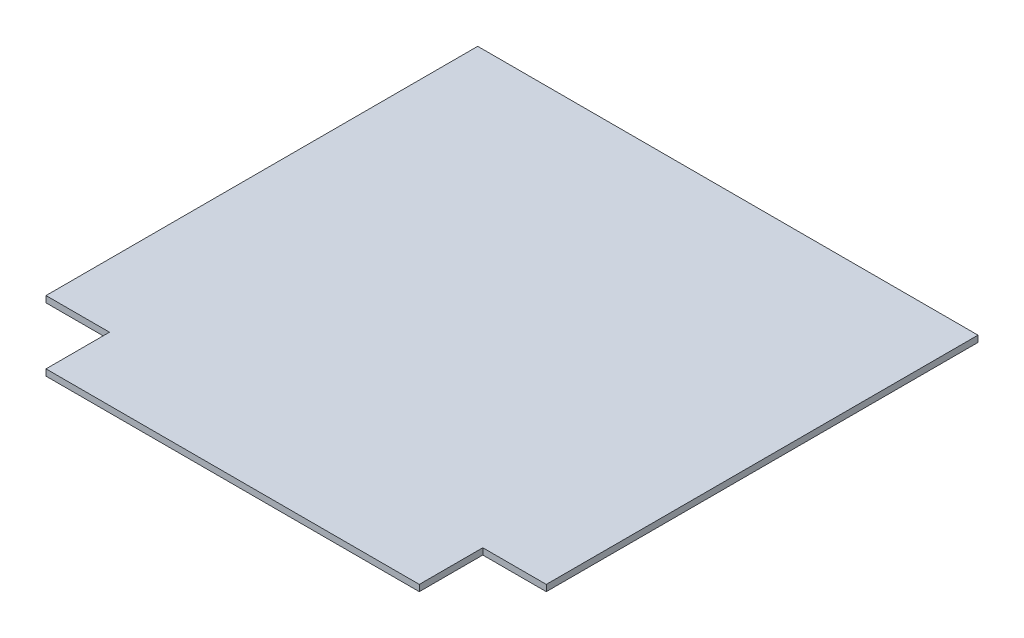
from build123d import *

# Parameters (mm, degrees)
BOSS_EXTRUDE1_DEPTH = 5


with BuildPart() as part:
    # Sketch1 → Boss-Extrude1 (new body)
    with BuildSketch(Plane(origin=(0, 0, 0), x_dir=(1, 0, 0), z_dir=(0, 1, 0))):
        Polygon((240.517670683, 195.823333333), (-153.482329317, 195.823333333), (-153.482329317, -144.176666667), (-103.482329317, -144.176666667), (-103.482329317, -194.176666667), (190.517670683, -194.176666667), (190.517670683, -144.176666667), (240.517670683, -144.176666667), align=None)
    extrude(amount=BOSS_EXTRUDE1_DEPTH)


solid = part.part
